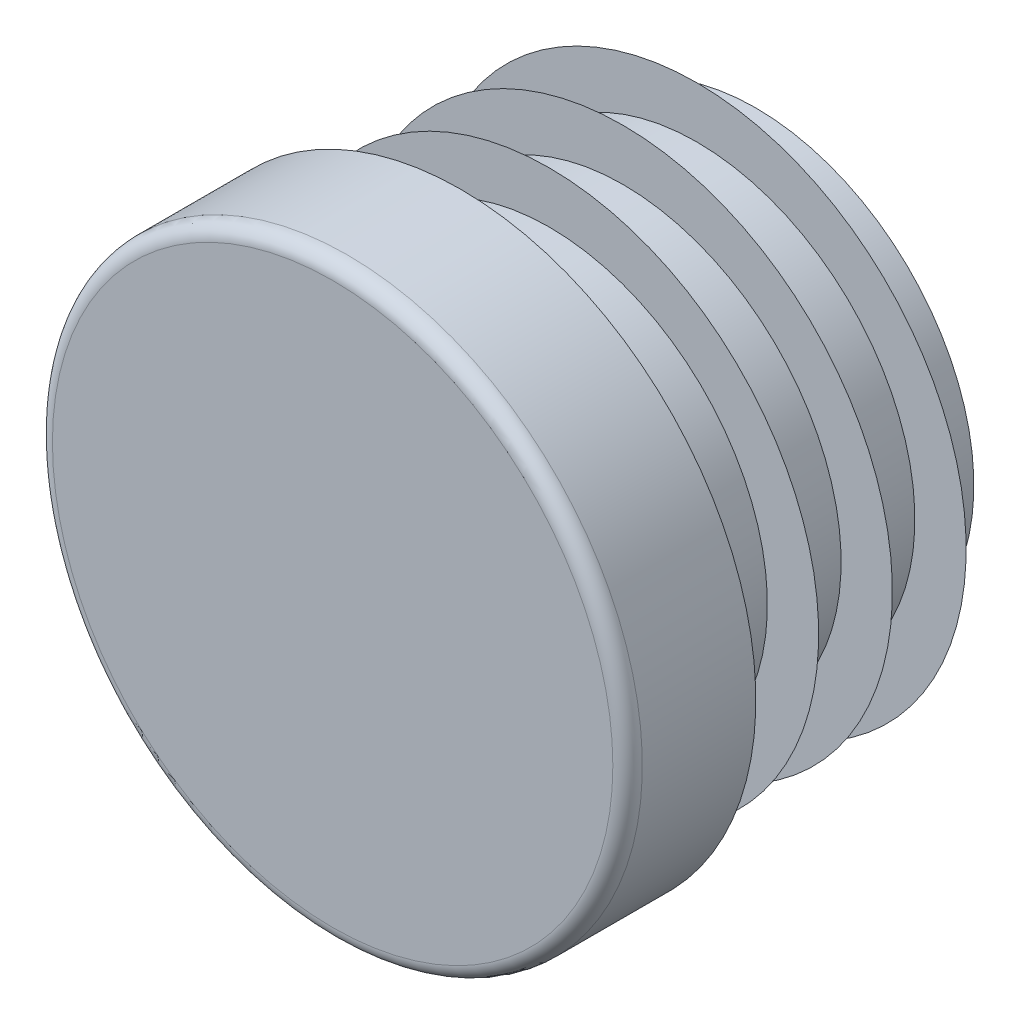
ISO-10303-21;
HEADER;
FILE_DESCRIPTION(('STEP AP214'),'2;1');
FILE_NAME('part.step','',(''),(''),'','','');
FILE_SCHEMA(('AUTOMOTIVE_DESIGN { 1 0 10303 214 1 1 1 1 }'));
ENDSEC;
DATA;
#1=APPLICATION_CONTEXT('core data for automotive mechanical design processes');
#2=APPLICATION_PROTOCOL_DEFINITION('international standard','automotive_design',2000,#1);
#3=PRODUCT_CONTEXT('',#1,'mechanical');
#4=PRODUCT('Part','Part','',(#3));
#5=PRODUCT_RELATED_PRODUCT_CATEGORY('part','',(#4));
#6=PRODUCT_DEFINITION_FORMATION('','',#4);
#7=PRODUCT_DEFINITION_CONTEXT('part definition',#1,'design');
#8=PRODUCT_DEFINITION('design','',#6,#7);
#9=PRODUCT_DEFINITION_SHAPE('','',#8);
#10=(LENGTH_UNIT() NAMED_UNIT(*) SI_UNIT(.MILLI.,.METRE.));
#11=(NAMED_UNIT(*) PLANE_ANGLE_UNIT() SI_UNIT($,.RADIAN.));
#12=(NAMED_UNIT(*) SI_UNIT($,.STERADIAN.) SOLID_ANGLE_UNIT());
#13=UNCERTAINTY_MEASURE_WITH_UNIT(LENGTH_MEASURE(1.E-05),#10,'distance_accuracy_value','');
#14=(GEOMETRIC_REPRESENTATION_CONTEXT(3) GLOBAL_UNCERTAINTY_ASSIGNED_CONTEXT((#13)) GLOBAL_UNIT_ASSIGNED_CONTEXT((#10,
#11,#12)) REPRESENTATION_CONTEXT('',''));
#15=CARTESIAN_POINT('',(0.,0.,0.));
#16=DIRECTION('',(0.,0.,1.));
#17=DIRECTION('',(1.,0.,0.));
#18=AXIS2_PLACEMENT_3D('',#15,#16,#17);
#19=CARTESIAN_POINT('',(0.,0.,5.));
#20=DIRECTION('',(0.,0.,-1.));
#21=DIRECTION('',(0.,1.,0.));
#22=AXIS2_PLACEMENT_3D('',#19,#20,#21);
#23=PLANE('',#22);
#24=CARTESIAN_POINT('',(0.,0.,5.));
#25=DIRECTION('',(0.,0.,-1.));
#26=DIRECTION('',(0.,1.,0.));
#27=AXIS2_PLACEMENT_3D('',#24,#25,#26);
#28=CIRCLE('',#27,10.925);
#29=CARTESIAN_POINT('',(0.,10.925,5.));
#30=VERTEX_POINT('',#29);
#31=EDGE_CURVE('E8',#30,#30,#28,.T.);
#32=ORIENTED_EDGE('',*,*,#31,.F.);
#33=EDGE_LOOP('',(#32));
#34=FACE_BOUND('',#33,.T.);
#35=ADVANCED_FACE('F12',(#34),#23,.F.);
#36=CARTESIAN_POINT('',(0.,0.,4.425));
#37=DIRECTION('',(0.,0.,-1.));
#38=DIRECTION('',(0.,1.,0.));
#39=AXIS2_PLACEMENT_3D('',#36,#37,#38);
#40=TOROIDAL_SURFACE('',#39,10.925,0.575);
#41=ORIENTED_EDGE('',*,*,#31,.T.);
#42=EDGE_LOOP('',(#41));
#43=FACE_BOUND('',#42,.T.);
#44=CARTESIAN_POINT('',(0.,0.,4.425));
#45=DIRECTION('',(0.,0.,-1.));
#46=DIRECTION('',(0.,1.,0.));
#47=AXIS2_PLACEMENT_3D('',#44,#45,#46);
#48=CIRCLE('',#47,11.5);
#49=CARTESIAN_POINT('',(0.,11.5,4.425));
#50=VERTEX_POINT('',#49);
#51=EDGE_CURVE('E18',#50,#50,#48,.T.);
#52=ORIENTED_EDGE('',*,*,#51,.F.);
#53=EDGE_LOOP('',(#52));
#54=FACE_BOUND('',#53,.T.);
#55=ADVANCED_FACE('F159',(#43,#54),#40,.T.);
#56=CARTESIAN_POINT('',(0.,0.,-11.5));
#57=DIRECTION('',(0.,0.,-1.));
#58=DIRECTION('',(0.,1.,0.));
#59=AXIS2_PLACEMENT_3D('',#56,#57,#58);
#60=CYLINDRICAL_SURFACE('',#59,11.5);
#61=CARTESIAN_POINT('',(0.,0.,0.));
#62=DIRECTION('',(0.,0.,-1.));
#63=DIRECTION('',(0.,1.,0.));
#64=AXIS2_PLACEMENT_3D('',#61,#62,#63);
#65=CIRCLE('',#64,11.5);
#66=CARTESIAN_POINT('',(0.,11.5,0.));
#67=VERTEX_POINT('',#66);
#68=EDGE_CURVE('E22',#67,#67,#65,.T.);
#69=ORIENTED_EDGE('',*,*,#68,.F.);
#70=EDGE_LOOP('',(#69));
#71=FACE_BOUND('',#70,.T.);
#72=ORIENTED_EDGE('',*,*,#51,.T.);
#73=EDGE_LOOP('',(#72));
#74=FACE_BOUND('',#73,.T.);
#75=ADVANCED_FACE('F154',(#71,#74),#60,.T.);
#76=CARTESIAN_POINT('',(11.5,0.,0.));
#77=DIRECTION('',(0.,0.,1.));
#78=DIRECTION('',(0.,-1.,0.));
#79=AXIS2_PLACEMENT_3D('',#76,#77,#78);
#80=PLANE('',#79);
#81=CARTESIAN_POINT('',(0.,0.,0.));
#82=DIRECTION('',(0.,0.,-1.));
#83=DIRECTION('',(0.,1.,0.));
#84=AXIS2_PLACEMENT_3D('',#81,#82,#83);
#85=CIRCLE('',#84,8.5);
#86=CARTESIAN_POINT('',(0.,8.5,0.));
#87=VERTEX_POINT('',#86);
#88=EDGE_CURVE('E26',#87,#87,#85,.T.);
#89=ORIENTED_EDGE('',*,*,#88,.F.);
#90=EDGE_LOOP('',(#89));
#91=FACE_BOUND('',#90,.T.);
#92=ORIENTED_EDGE('',*,*,#68,.T.);
#93=EDGE_LOOP('',(#92));
#94=FACE_BOUND('',#93,.T.);
#95=ADVANCED_FACE('F148',(#91,#94),#80,.F.);
#96=CARTESIAN_POINT('',(0.,0.,-11.5));
#97=DIRECTION('',(0.,0.,-1.));
#98=DIRECTION('',(0.,1.,0.));
#99=AXIS2_PLACEMENT_3D('',#96,#97,#98);
#100=CYLINDRICAL_SURFACE('',#99,8.5);
#101=CARTESIAN_POINT('',(0.,0.,-0.575));
#102=DIRECTION('',(0.,0.,-1.));
#103=DIRECTION('',(0.,1.,0.));
#104=AXIS2_PLACEMENT_3D('',#101,#102,#103);
#105=CIRCLE('',#104,8.5);
#106=CARTESIAN_POINT('',(0.,8.5,-0.575));
#107=VERTEX_POINT('',#106);
#108=EDGE_CURVE('E31',#107,#107,#105,.T.);
#109=ORIENTED_EDGE('',*,*,#108,.F.);
#110=EDGE_LOOP('',(#109));
#111=FACE_BOUND('',#110,.T.);
#112=ORIENTED_EDGE('',*,*,#88,.T.);
#113=EDGE_LOOP('',(#112));
#114=FACE_BOUND('',#113,.T.);
#115=ADVANCED_FACE('F142',(#111,#114),#100,.T.);
#116=CARTESIAN_POINT('',(8.5,0.,-0.575));
#117=DIRECTION('',(0.,0.,-1.));
#118=DIRECTION('',(0.,1.,0.));
#119=AXIS2_PLACEMENT_3D('',#116,#117,#118);
#120=PLANE('',#119);
#121=CARTESIAN_POINT('',(0.,0.,-0.575));
#122=DIRECTION('',(0.,0.,-1.));
#123=DIRECTION('',(0.,1.,0.));
#124=AXIS2_PLACEMENT_3D('',#121,#122,#123);
#125=CIRCLE('',#124,10.5);
#126=CARTESIAN_POINT('',(0.,10.5,-0.575));
#127=VERTEX_POINT('',#126);
#128=EDGE_CURVE('E34',#127,#127,#125,.T.);
#129=ORIENTED_EDGE('',*,*,#128,.F.);
#130=EDGE_LOOP('',(#129));
#131=FACE_BOUND('',#130,.T.);
#132=ORIENTED_EDGE('',*,*,#108,.T.);
#133=EDGE_LOOP('',(#132));
#134=FACE_BOUND('',#133,.T.);
#135=ADVANCED_FACE('F136',(#131,#134),#120,.F.);
#136=CARTESIAN_POINT('',(0.,0.,-0.575));
#137=DIRECTION('',(0.,0.,1.));
#138=DIRECTION('',(0.,-1.,0.));
#139=AXIS2_PLACEMENT_3D('',#136,#137,#138);
#140=CONICAL_SURFACE('',#139,10.5,0.959931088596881);
#141=CARTESIAN_POINT('',(0.,0.,-1.97541507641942));
#142=DIRECTION('',(0.,0.,-1.));
#143=DIRECTION('',(0.,1.,0.));
#144=AXIS2_PLACEMENT_3D('',#141,#142,#143);
#145=CIRCLE('',#144,8.5);
#146=CARTESIAN_POINT('',(0.,8.5,-1.97541507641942));
#147=VERTEX_POINT('',#146);
#148=EDGE_CURVE('E37',#147,#147,#145,.T.);
#149=ORIENTED_EDGE('',*,*,#148,.F.);
#150=EDGE_LOOP('',(#149));
#151=FACE_BOUND('',#150,.T.);
#152=ORIENTED_EDGE('',*,*,#128,.T.);
#153=EDGE_LOOP('',(#152));
#154=FACE_BOUND('',#153,.T.);
#155=ADVANCED_FACE('F130',(#151,#154),#140,.T.);
#156=CARTESIAN_POINT('',(0.,0.,-11.5));
#157=DIRECTION('',(0.,0.,-1.));
#158=DIRECTION('',(0.,1.,0.));
#159=AXIS2_PLACEMENT_3D('',#156,#157,#158);
#160=CYLINDRICAL_SURFACE('',#159,8.5);
#161=CARTESIAN_POINT('',(0.,0.,-3.45));
#162=DIRECTION('',(0.,0.,-1.));
#163=DIRECTION('',(0.,1.,0.));
#164=AXIS2_PLACEMENT_3D('',#161,#162,#163);
#165=CIRCLE('',#164,8.5);
#166=CARTESIAN_POINT('',(0.,8.5,-3.45));
#167=VERTEX_POINT('',#166);
#168=EDGE_CURVE('E40',#167,#167,#165,.T.);
#169=ORIENTED_EDGE('',*,*,#168,.F.);
#170=EDGE_LOOP('',(#169));
#171=FACE_BOUND('',#170,.T.);
#172=ORIENTED_EDGE('',*,*,#148,.T.);
#173=EDGE_LOOP('',(#172));
#174=FACE_BOUND('',#173,.T.);
#175=ADVANCED_FACE('F124',(#171,#174),#160,.T.);
#176=CARTESIAN_POINT('',(8.5,0.,-3.45));
#177=DIRECTION('',(0.,0.,-1.));
#178=DIRECTION('',(0.,1.,0.));
#179=AXIS2_PLACEMENT_3D('',#176,#177,#178);
#180=PLANE('',#179);
#181=CARTESIAN_POINT('',(0.,0.,-3.45));
#182=DIRECTION('',(0.,0.,-1.));
#183=DIRECTION('',(0.,1.,0.));
#184=AXIS2_PLACEMENT_3D('',#181,#182,#183);
#185=CIRCLE('',#184,10.5);
#186=CARTESIAN_POINT('',(0.,10.5,-3.45));
#187=VERTEX_POINT('',#186);
#188=EDGE_CURVE('E43',#187,#187,#185,.T.);
#189=ORIENTED_EDGE('',*,*,#188,.F.);
#190=EDGE_LOOP('',(#189));
#191=FACE_BOUND('',#190,.T.);
#192=ORIENTED_EDGE('',*,*,#168,.T.);
#193=EDGE_LOOP('',(#192));
#194=FACE_BOUND('',#193,.T.);
#195=ADVANCED_FACE('F118',(#191,#194),#180,.F.);
#196=CARTESIAN_POINT('',(0.,0.,-3.45));
#197=DIRECTION('',(0.,0.,1.));
#198=DIRECTION('',(0.,-1.,0.));
#199=AXIS2_PLACEMENT_3D('',#196,#197,#198);
#200=CONICAL_SURFACE('',#199,10.5,0.959931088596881);
#201=CARTESIAN_POINT('',(0.,0.,-4.85041507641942));
#202=DIRECTION('',(0.,0.,-1.));
#203=DIRECTION('',(0.,1.,0.));
#204=AXIS2_PLACEMENT_3D('',#201,#202,#203);
#205=CIRCLE('',#204,8.5);
#206=CARTESIAN_POINT('',(0.,8.5,-4.85041507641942));
#207=VERTEX_POINT('',#206);
#208=EDGE_CURVE('E46',#207,#207,#205,.T.);
#209=ORIENTED_EDGE('',*,*,#208,.F.);
#210=EDGE_LOOP('',(#209));
#211=FACE_BOUND('',#210,.T.);
#212=ORIENTED_EDGE('',*,*,#188,.T.);
#213=EDGE_LOOP('',(#212));
#214=FACE_BOUND('',#213,.T.);
#215=ADVANCED_FACE('F112',(#211,#214),#200,.T.);
#216=CARTESIAN_POINT('',(0.,0.,-11.5));
#217=DIRECTION('',(0.,0.,-1.));
#218=DIRECTION('',(0.,1.,0.));
#219=AXIS2_PLACEMENT_3D('',#216,#217,#218);
#220=CYLINDRICAL_SURFACE('',#219,8.5);
#221=CARTESIAN_POINT('',(0.,0.,-6.325));
#222=DIRECTION('',(0.,0.,-1.));
#223=DIRECTION('',(0.,1.,0.));
#224=AXIS2_PLACEMENT_3D('',#221,#222,#223);
#225=CIRCLE('',#224,8.5);
#226=CARTESIAN_POINT('',(0.,8.5,-6.325));
#227=VERTEX_POINT('',#226);
#228=EDGE_CURVE('E49',#227,#227,#225,.T.);
#229=ORIENTED_EDGE('',*,*,#228,.F.);
#230=EDGE_LOOP('',(#229));
#231=FACE_BOUND('',#230,.T.);
#232=ORIENTED_EDGE('',*,*,#208,.T.);
#233=EDGE_LOOP('',(#232));
#234=FACE_BOUND('',#233,.T.);
#235=ADVANCED_FACE('F106',(#231,#234),#220,.T.);
#236=CARTESIAN_POINT('',(8.5,0.,-6.325));
#237=DIRECTION('',(0.,0.,-1.));
#238=DIRECTION('',(0.,1.,0.));
#239=AXIS2_PLACEMENT_3D('',#236,#237,#238);
#240=PLANE('',#239);
#241=CARTESIAN_POINT('',(0.,0.,-6.325));
#242=DIRECTION('',(0.,0.,-1.));
#243=DIRECTION('',(0.,1.,0.));
#244=AXIS2_PLACEMENT_3D('',#241,#242,#243);
#245=CIRCLE('',#244,10.5);
#246=CARTESIAN_POINT('',(0.,10.5,-6.325));
#247=VERTEX_POINT('',#246);
#248=EDGE_CURVE('E52',#247,#247,#245,.T.);
#249=ORIENTED_EDGE('',*,*,#248,.F.);
#250=EDGE_LOOP('',(#249));
#251=FACE_BOUND('',#250,.T.);
#252=ORIENTED_EDGE('',*,*,#228,.T.);
#253=EDGE_LOOP('',(#252));
#254=FACE_BOUND('',#253,.T.);
#255=ADVANCED_FACE('F100',(#251,#254),#240,.F.);
#256=CARTESIAN_POINT('',(0.,0.,-6.325));
#257=DIRECTION('',(0.,0.,1.));
#258=DIRECTION('',(0.,-1.,0.));
#259=AXIS2_PLACEMENT_3D('',#256,#257,#258);
#260=CONICAL_SURFACE('',#259,10.5,0.959931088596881);
#261=CARTESIAN_POINT('',(0.,0.,-7.72541507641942));
#262=DIRECTION('',(0.,0.,-1.));
#263=DIRECTION('',(0.,1.,0.));
#264=AXIS2_PLACEMENT_3D('',#261,#262,#263);
#265=CIRCLE('',#264,8.5);
#266=CARTESIAN_POINT('',(0.,8.5,-7.72541507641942));
#267=VERTEX_POINT('',#266);
#268=EDGE_CURVE('E55',#267,#267,#265,.T.);
#269=ORIENTED_EDGE('',*,*,#268,.F.);
#270=EDGE_LOOP('',(#269));
#271=FACE_BOUND('',#270,.T.);
#272=ORIENTED_EDGE('',*,*,#248,.T.);
#273=EDGE_LOOP('',(#272));
#274=FACE_BOUND('',#273,.T.);
#275=ADVANCED_FACE('F94',(#271,#274),#260,.T.);
#276=CARTESIAN_POINT('',(0.,0.,-11.5));
#277=DIRECTION('',(0.,0.,-1.));
#278=DIRECTION('',(0.,1.,0.));
#279=AXIS2_PLACEMENT_3D('',#276,#277,#278);
#280=CYLINDRICAL_SURFACE('',#279,8.5);
#281=CARTESIAN_POINT('',(0.,0.,-9.2));
#282=DIRECTION('',(0.,0.,-1.));
#283=DIRECTION('',(0.,1.,0.));
#284=AXIS2_PLACEMENT_3D('',#281,#282,#283);
#285=CIRCLE('',#284,8.5);
#286=CARTESIAN_POINT('',(0.,8.5,-9.2));
#287=VERTEX_POINT('',#286);
#288=EDGE_CURVE('E58',#287,#287,#285,.T.);
#289=ORIENTED_EDGE('',*,*,#288,.F.);
#290=EDGE_LOOP('',(#289));
#291=FACE_BOUND('',#290,.T.);
#292=ORIENTED_EDGE('',*,*,#268,.T.);
#293=EDGE_LOOP('',(#292));
#294=FACE_BOUND('',#293,.T.);
#295=ADVANCED_FACE('F88',(#291,#294),#280,.T.);
#296=CARTESIAN_POINT('',(8.5,0.,-9.2));
#297=DIRECTION('',(0.,0.,-1.));
#298=DIRECTION('',(0.,1.,0.));
#299=AXIS2_PLACEMENT_3D('',#296,#297,#298);
#300=PLANE('',#299);
#301=CARTESIAN_POINT('',(0.,0.,-9.2));
#302=DIRECTION('',(0.,0.,-1.));
#303=DIRECTION('',(0.,1.,0.));
#304=AXIS2_PLACEMENT_3D('',#301,#302,#303);
#305=CIRCLE('',#304,10.5);
#306=CARTESIAN_POINT('',(0.,10.5,-9.2));
#307=VERTEX_POINT('',#306);
#308=EDGE_CURVE('E61',#307,#307,#305,.T.);
#309=ORIENTED_EDGE('',*,*,#308,.F.);
#310=EDGE_LOOP('',(#309));
#311=FACE_BOUND('',#310,.T.);
#312=ORIENTED_EDGE('',*,*,#288,.T.);
#313=EDGE_LOOP('',(#312));
#314=FACE_BOUND('',#313,.T.);
#315=ADVANCED_FACE('F82',(#311,#314),#300,.F.);
#316=CARTESIAN_POINT('',(0.,0.,-9.2));
#317=DIRECTION('',(0.,0.,1.));
#318=DIRECTION('',(0.,-1.,0.));
#319=AXIS2_PLACEMENT_3D('',#316,#317,#318);
#320=CONICAL_SURFACE('',#319,10.5,0.959931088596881);
#321=CARTESIAN_POINT('',(0.,0.,-10.6004150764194));
#322=DIRECTION('',(0.,0.,-1.));
#323=DIRECTION('',(0.,1.,0.));
#324=AXIS2_PLACEMENT_3D('',#321,#322,#323);
#325=CIRCLE('',#324,8.5);
#326=CARTESIAN_POINT('',(0.,8.5,-10.6004150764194));
#327=VERTEX_POINT('',#326);
#328=EDGE_CURVE('E64',#327,#327,#325,.T.);
#329=ORIENTED_EDGE('',*,*,#328,.F.);
#330=EDGE_LOOP('',(#329));
#331=FACE_BOUND('',#330,.T.);
#332=ORIENTED_EDGE('',*,*,#308,.T.);
#333=EDGE_LOOP('',(#332));
#334=FACE_BOUND('',#333,.T.);
#335=ADVANCED_FACE('F76',(#331,#334),#320,.T.);
#336=CARTESIAN_POINT('',(0.,0.,-11.5));
#337=DIRECTION('',(0.,0.,-1.));
#338=DIRECTION('',(0.,1.,0.));
#339=AXIS2_PLACEMENT_3D('',#336,#337,#338);
#340=CYLINDRICAL_SURFACE('',#339,8.5);
#341=CARTESIAN_POINT('',(0.,0.,-11.5));
#342=DIRECTION('',(0.,0.,-1.));
#343=DIRECTION('',(0.,1.,0.));
#344=AXIS2_PLACEMENT_3D('',#341,#342,#343);
#345=CIRCLE('',#344,8.5);
#346=CARTESIAN_POINT('',(0.,8.5,-11.5));
#347=VERTEX_POINT('',#346);
#348=EDGE_CURVE('E67',#347,#347,#345,.T.);
#349=ORIENTED_EDGE('',*,*,#348,.F.);
#350=EDGE_LOOP('',(#349));
#351=FACE_BOUND('',#350,.T.);
#352=ORIENTED_EDGE('',*,*,#328,.T.);
#353=EDGE_LOOP('',(#352));
#354=FACE_BOUND('',#353,.T.);
#355=ADVANCED_FACE('F73',(#351,#354),#340,.T.);
#356=CARTESIAN_POINT('',(8.5,0.,-11.5));
#357=DIRECTION('',(0.,0.,1.));
#358=DIRECTION('',(0.,-1.,0.));
#359=AXIS2_PLACEMENT_3D('',#356,#357,#358);
#360=PLANE('',#359);
#361=ORIENTED_EDGE('',*,*,#348,.T.);
#362=EDGE_LOOP('',(#361));
#363=FACE_BOUND('',#362,.T.);
#364=ADVANCED_FACE('F71',(#363),#360,.F.);
#365=CLOSED_SHELL('',(#35,#55,#75,#95,#115,#135,#155,#175,#195,#215,#235,#255,#275,#295,#315,
#335,#355,#364));
#366=MANIFOLD_SOLID_BREP('B1',#365);
#367=ADVANCED_BREP_SHAPE_REPRESENTATION('',(#18,#366),#14);
#368=SHAPE_DEFINITION_REPRESENTATION(#9,#367);
ENDSEC;
END-ISO-10303-21;
